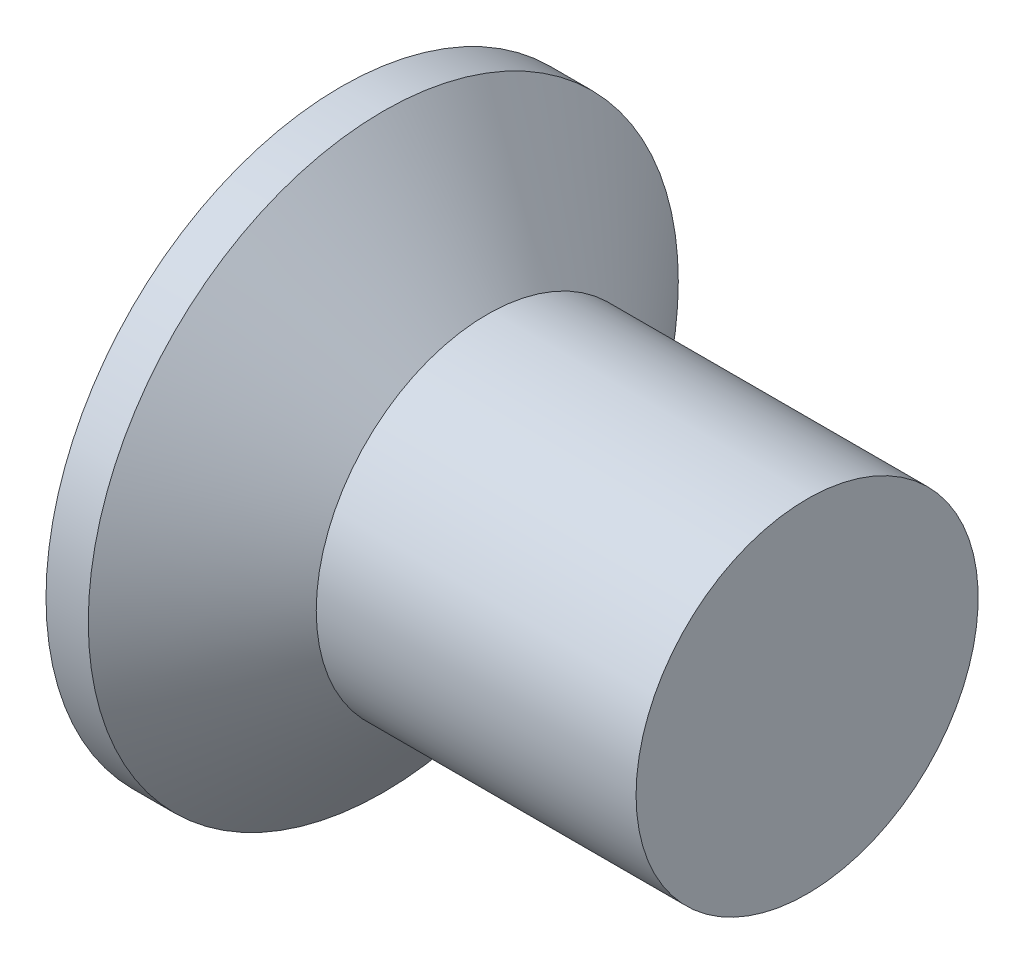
from build123d import *

# Parameters (mm, degrees)
CIRPATTERN1_COUNT = 2
CIRPATTERN1_ANGLE = 90


with BuildPart() as part:
    # BodySke → Base-Revolve (revolve)
    with BuildSketch(Plane.XY, mode=Mode.PRIVATE) as base_revolve_sk:
        Polygon((0, 0), (0, 3.0226), (0.432943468, 3.0226), (1.4986, 1.7526), (4.7752, 1.7526), (4.7752, 0), align=None)
    revolve(base_revolve_sk.sketch.rotate(Axis((-6.35, 0, 0), (1, 0, 0)), 90), axis=Axis((-6.35, 0, 0), (1, 0, 0)))

    # Sketch3 → Cross section 0
    with BuildSketch(Plane.ZY):
        with BuildLine():
            Line((-0.4191, 2.0574), (0.4191, 2.0574))
            Line((0.4191, 2.0574), (0.4191, -2.0574))
            Line((0.4191, -2.0574), (-0.4191, -2.0574))
            Line((-0.4191, -2.0574), (-0.4191, 2.0574))
        make_face()
    # Sketch4 → Cross section 1
    with BuildSketch(Plane.ZY.offset(-2.6924)):
        with BuildLine():
            Line((-0.20955, 0.20955), (0.20955, 0.20955))
            Line((0.20955, 0.20955), (0.20955, -0.20955))
            Line((0.20955, -0.20955), (-0.20955, -0.20955))
            Line((-0.20955, -0.20955), (-0.20955, 0.20955))
        make_face()
    cross = loft(mode=Mode.SUBTRACT)

    # CirPattern1: Cross ×2 about axis
    cirpattern1_axis = Axis((0, 0, 0), (1, 0, 0))
    for i in range(1, CIRPATTERN1_COUNT):
        add(cross.rotate(cirpattern1_axis, i * CIRPATTERN1_ANGLE / (CIRPATTERN1_COUNT - 1)), mode=Mode.SUBTRACT)


solid = part.part
